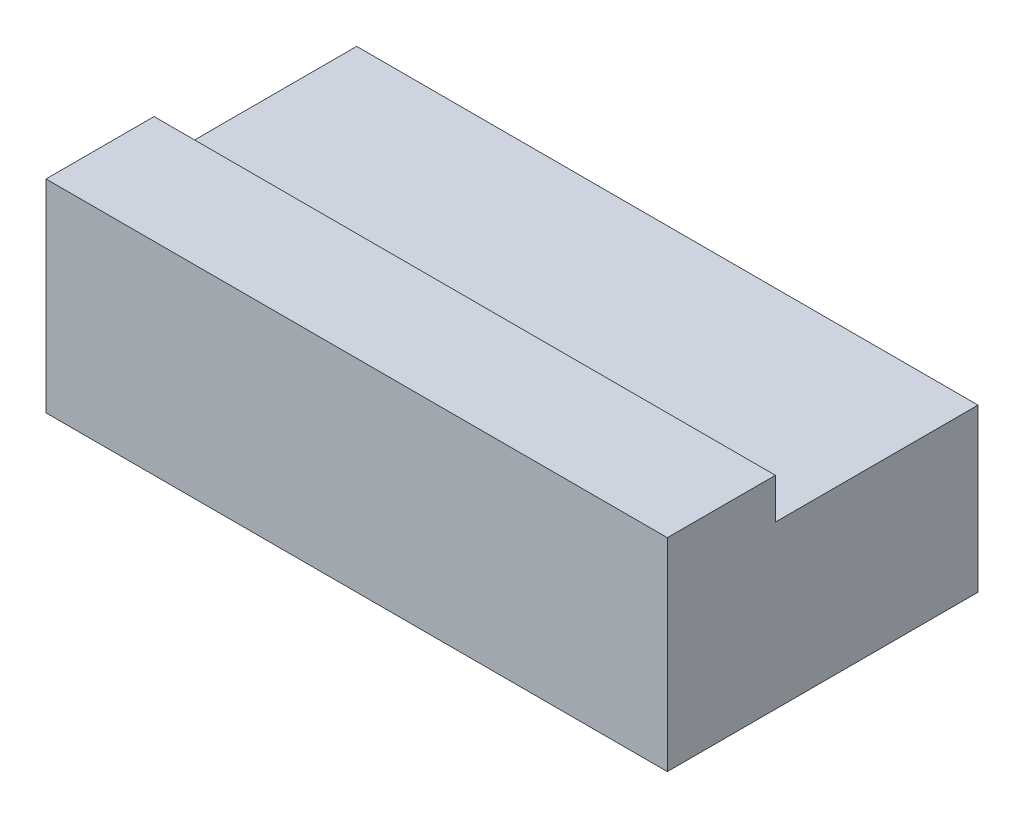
ISO-10303-21;
HEADER;
FILE_DESCRIPTION(('STEP AP214'),'2;1');
FILE_NAME('part.step','',(''),(''),'','','');
FILE_SCHEMA(('AUTOMOTIVE_DESIGN { 1 0 10303 214 1 1 1 1 }'));
ENDSEC;
DATA;
#1=APPLICATION_CONTEXT('core data for automotive mechanical design processes');
#2=APPLICATION_PROTOCOL_DEFINITION('international standard','automotive_design',2000,#1);
#3=PRODUCT_CONTEXT('',#1,'mechanical');
#4=PRODUCT('Part','Part','',(#3));
#5=PRODUCT_RELATED_PRODUCT_CATEGORY('part','',(#4));
#6=PRODUCT_DEFINITION_FORMATION('','',#4);
#7=PRODUCT_DEFINITION_CONTEXT('part definition',#1,'design');
#8=PRODUCT_DEFINITION('design','',#6,#7);
#9=PRODUCT_DEFINITION_SHAPE('','',#8);
#10=(LENGTH_UNIT() NAMED_UNIT(*) SI_UNIT(.MILLI.,.METRE.));
#11=(NAMED_UNIT(*) PLANE_ANGLE_UNIT() SI_UNIT($,.RADIAN.));
#12=(NAMED_UNIT(*) SI_UNIT($,.STERADIAN.) SOLID_ANGLE_UNIT());
#13=UNCERTAINTY_MEASURE_WITH_UNIT(LENGTH_MEASURE(1.E-05),#10,'distance_accuracy_value','');
#14=(GEOMETRIC_REPRESENTATION_CONTEXT(3) GLOBAL_UNCERTAINTY_ASSIGNED_CONTEXT((#13)) GLOBAL_UNIT_ASSIGNED_CONTEXT((#10,
#11,#12)) REPRESENTATION_CONTEXT('',''));
#15=CARTESIAN_POINT('',(0.,0.,0.));
#16=DIRECTION('',(0.,0.,1.));
#17=DIRECTION('',(1.,0.,0.));
#18=AXIS2_PLACEMENT_3D('',#15,#16,#17);
#19=CARTESIAN_POINT('',(-115.,37.5,-57.5));
#20=DIRECTION('',(0.,0.,1.));
#21=DIRECTION('',(1.,0.,0.));
#22=AXIS2_PLACEMENT_3D('',#19,#20,#21);
#23=PLANE('',#22);
#24=DIRECTION('',(-1.,0.,0.));
#25=VECTOR('',#24,1.);
#26=CARTESIAN_POINT('',(-115.,22.5,-57.5));
#27=LINE('',#26,#25);
#28=CARTESIAN_POINT('',(115.,22.5,-57.5));
#29=VERTEX_POINT('',#28);
#30=CARTESIAN_POINT('',(-115.,22.5,-57.5));
#31=VERTEX_POINT('',#30);
#32=EDGE_CURVE('E132',#29,#31,#27,.T.);
#33=ORIENTED_EDGE('',*,*,#32,.F.);
#34=DIRECTION('',(0.,-1.,0.));
#35=VECTOR('',#34,1.);
#36=CARTESIAN_POINT('',(115.,37.5,-57.5));
#37=LINE('',#36,#35);
#38=CARTESIAN_POINT('',(115.,-37.5,-57.5));
#39=VERTEX_POINT('',#38);
#40=EDGE_CURVE('E11',#29,#39,#37,.T.);
#41=ORIENTED_EDGE('',*,*,#40,.T.);
#42=DIRECTION('',(-1.,0.,0.));
#43=VECTOR('',#42,1.);
#44=CARTESIAN_POINT('',(-115.,-37.5,-57.5));
#45=LINE('',#44,#43);
#46=CARTESIAN_POINT('',(-115.,-37.5,-57.5));
#47=VERTEX_POINT('',#46);
#48=EDGE_CURVE('E106',#39,#47,#45,.T.);
#49=ORIENTED_EDGE('',*,*,#48,.T.);
#50=DIRECTION('',(0.,-1.,0.));
#51=VECTOR('',#50,1.);
#52=CARTESIAN_POINT('',(-115.,37.5,-57.5));
#53=LINE('',#52,#51);
#54=EDGE_CURVE('E47',#31,#47,#53,.T.);
#55=ORIENTED_EDGE('',*,*,#54,.F.);
#56=EDGE_LOOP('',(#33,#41,#49,#55));
#57=FACE_BOUND('',#56,.T.);
#58=ADVANCED_FACE('F38',(#57),#23,.F.);
#59=CARTESIAN_POINT('',(115.,37.5,-57.5));
#60=DIRECTION('',(-1.,0.,0.));
#61=DIRECTION('',(0.,0.,1.));
#62=AXIS2_PLACEMENT_3D('',#59,#60,#61);
#63=PLANE('',#62);
#64=DIRECTION('',(0.,0.,-1.));
#65=VECTOR('',#64,1.);
#66=CARTESIAN_POINT('',(115.,22.5,-57.5));
#67=LINE('',#66,#65);
#68=CARTESIAN_POINT('',(115.,22.5,17.5));
#69=VERTEX_POINT('',#68);
#70=EDGE_CURVE('E135',#69,#29,#67,.T.);
#71=ORIENTED_EDGE('',*,*,#70,.F.);
#72=DIRECTION('',(0.,1.,0.));
#73=VECTOR('',#72,1.);
#74=CARTESIAN_POINT('',(115.,22.5,17.5));
#75=LINE('',#74,#73);
#76=CARTESIAN_POINT('',(115.,37.5,17.5));
#77=VERTEX_POINT('',#76);
#78=EDGE_CURVE('E108',#69,#77,#75,.T.);
#79=ORIENTED_EDGE('',*,*,#78,.T.);
#80=DIRECTION('',(0.,0.,-1.));
#81=VECTOR('',#80,1.);
#82=CARTESIAN_POINT('',(115.,37.5,-57.5));
#83=LINE('',#82,#81);
#84=CARTESIAN_POINT('',(115.,37.5,57.5));
#85=VERTEX_POINT('',#84);
#86=EDGE_CURVE('E92',#85,#77,#83,.T.);
#87=ORIENTED_EDGE('',*,*,#86,.F.);
#88=DIRECTION('',(0.,-1.,0.));
#89=VECTOR('',#88,1.);
#90=CARTESIAN_POINT('',(115.,37.5,57.5));
#91=LINE('',#90,#89);
#92=CARTESIAN_POINT('',(115.,-37.5,57.5));
#93=VERTEX_POINT('',#92);
#94=EDGE_CURVE('E84',#85,#93,#91,.T.);
#95=ORIENTED_EDGE('',*,*,#94,.T.);
#96=DIRECTION('',(0.,0.,-1.));
#97=VECTOR('',#96,1.);
#98=CARTESIAN_POINT('',(115.,-37.5,-57.5));
#99=LINE('',#98,#97);
#100=EDGE_CURVE('E99',#93,#39,#99,.T.);
#101=ORIENTED_EDGE('',*,*,#100,.T.);
#102=ORIENTED_EDGE('',*,*,#40,.F.);
#103=EDGE_LOOP('',(#71,#79,#87,#95,#101,#102));
#104=FACE_BOUND('',#103,.T.);
#105=ADVANCED_FACE('F40',(#104),#63,.F.);
#106=CARTESIAN_POINT('',(-115.,37.5,-57.5));
#107=DIRECTION('',(1.,0.,0.));
#108=DIRECTION('',(0.,0.,-1.));
#109=AXIS2_PLACEMENT_3D('',#106,#107,#108);
#110=PLANE('',#109);
#111=DIRECTION('',(0.,0.,1.));
#112=VECTOR('',#111,1.);
#113=CARTESIAN_POINT('',(-115.,37.5,-57.5));
#114=LINE('',#113,#112);
#115=CARTESIAN_POINT('',(-115.,37.5,17.5));
#116=VERTEX_POINT('',#115);
#117=CARTESIAN_POINT('',(-115.,37.5,57.5));
#118=VERTEX_POINT('',#117);
#119=EDGE_CURVE('E153',#116,#118,#114,.T.);
#120=ORIENTED_EDGE('',*,*,#119,.F.);
#121=DIRECTION('',(0.,1.,0.));
#122=VECTOR('',#121,1.);
#123=CARTESIAN_POINT('',(-115.,22.5,17.5));
#124=LINE('',#123,#122);
#125=CARTESIAN_POINT('',(-115.,22.5,17.5));
#126=VERTEX_POINT('',#125);
#127=EDGE_CURVE('E54',#126,#116,#124,.T.);
#128=ORIENTED_EDGE('',*,*,#127,.F.);
#129=DIRECTION('',(0.,0.,1.));
#130=VECTOR('',#129,1.);
#131=CARTESIAN_POINT('',(-115.,22.5,-57.5));
#132=LINE('',#131,#130);
#133=EDGE_CURVE('E127',#31,#126,#132,.T.);
#134=ORIENTED_EDGE('',*,*,#133,.F.);
#135=ORIENTED_EDGE('',*,*,#54,.T.);
#136=DIRECTION('',(0.,0.,1.));
#137=VECTOR('',#136,1.);
#138=CARTESIAN_POINT('',(-115.,-37.5,-57.5));
#139=LINE('',#138,#137);
#140=CARTESIAN_POINT('',(-115.,-37.5,57.5));
#141=VERTEX_POINT('',#140);
#142=EDGE_CURVE('E93',#47,#141,#139,.T.);
#143=ORIENTED_EDGE('',*,*,#142,.T.);
#144=DIRECTION('',(0.,-1.,0.));
#145=VECTOR('',#144,1.);
#146=CARTESIAN_POINT('',(-115.,37.5,57.5));
#147=LINE('',#146,#145);
#148=EDGE_CURVE('E87',#118,#141,#147,.T.);
#149=ORIENTED_EDGE('',*,*,#148,.F.);
#150=EDGE_LOOP('',(#120,#128,#134,#135,#143,#149));
#151=FACE_BOUND('',#150,.T.);
#152=ADVANCED_FACE('F125',(#151),#110,.F.);
#153=CARTESIAN_POINT('',(-115.,37.5,57.5));
#154=DIRECTION('',(0.,0.,-1.));
#155=DIRECTION('',(-1.,0.,0.));
#156=AXIS2_PLACEMENT_3D('',#153,#154,#155);
#157=PLANE('',#156);
#158=DIRECTION('',(1.,0.,0.));
#159=VECTOR('',#158,1.);
#160=CARTESIAN_POINT('',(-115.,-37.5,57.5));
#161=LINE('',#160,#159);
#162=EDGE_CURVE('E81',#141,#93,#161,.T.);
#163=ORIENTED_EDGE('',*,*,#162,.T.);
#164=ORIENTED_EDGE('',*,*,#94,.F.);
#165=DIRECTION('',(1.,0.,0.));
#166=VECTOR('',#165,1.);
#167=CARTESIAN_POINT('',(-115.,37.5,57.5));
#168=LINE('',#167,#166);
#169=EDGE_CURVE('E63',#118,#85,#168,.T.);
#170=ORIENTED_EDGE('',*,*,#169,.F.);
#171=ORIENTED_EDGE('',*,*,#148,.T.);
#172=EDGE_LOOP('',(#163,#164,#170,#171));
#173=FACE_BOUND('',#172,.T.);
#174=ADVANCED_FACE('F83',(#173),#157,.F.);
#175=CARTESIAN_POINT('',(0.,37.5,0.));
#176=DIRECTION('',(0.,1.,0.));
#177=DIRECTION('',(0.,0.,1.));
#178=AXIS2_PLACEMENT_3D('',#175,#176,#177);
#179=PLANE('',#178);
#180=DIRECTION('',(1.,0.,0.));
#181=VECTOR('',#180,1.);
#182=CARTESIAN_POINT('',(-115.,37.5,17.5));
#183=LINE('',#182,#181);
#184=EDGE_CURVE('E145',#116,#77,#183,.T.);
#185=ORIENTED_EDGE('',*,*,#184,.F.);
#186=ORIENTED_EDGE('',*,*,#119,.T.);
#187=ORIENTED_EDGE('',*,*,#169,.T.);
#188=ORIENTED_EDGE('',*,*,#86,.T.);
#189=EDGE_LOOP('',(#185,#186,#187,#188));
#190=FACE_BOUND('',#189,.T.);
#191=ADVANCED_FACE('F163',(#190),#179,.T.);
#192=CARTESIAN_POINT('',(0.,-37.5,0.));
#193=DIRECTION('',(0.,1.,0.));
#194=DIRECTION('',(0.,0.,1.));
#195=AXIS2_PLACEMENT_3D('',#192,#193,#194);
#196=PLANE('',#195);
#197=ORIENTED_EDGE('',*,*,#100,.F.);
#198=ORIENTED_EDGE('',*,*,#162,.F.);
#199=ORIENTED_EDGE('',*,*,#142,.F.);
#200=ORIENTED_EDGE('',*,*,#48,.F.);
#201=EDGE_LOOP('',(#197,#198,#199,#200));
#202=FACE_BOUND('',#201,.T.);
#203=ADVANCED_FACE('F104',(#202),#196,.F.);
#204=CARTESIAN_POINT('',(-115.,22.5,17.5));
#205=DIRECTION('',(0.,0.,1.));
#206=DIRECTION('',(1.,0.,0.));
#207=AXIS2_PLACEMENT_3D('',#204,#205,#206);
#208=PLANE('',#207);
#209=ORIENTED_EDGE('',*,*,#184,.T.);
#210=ORIENTED_EDGE('',*,*,#78,.F.);
#211=DIRECTION('',(1.,0.,0.));
#212=VECTOR('',#211,1.);
#213=CARTESIAN_POINT('',(-115.,22.5,17.5));
#214=LINE('',#213,#212);
#215=EDGE_CURVE('E146',#126,#69,#214,.T.);
#216=ORIENTED_EDGE('',*,*,#215,.F.);
#217=ORIENTED_EDGE('',*,*,#127,.T.);
#218=EDGE_LOOP('',(#209,#210,#216,#217));
#219=FACE_BOUND('',#218,.T.);
#220=ADVANCED_FACE('F147',(#219),#208,.F.);
#221=CARTESIAN_POINT('',(0.,22.5,0.));
#222=DIRECTION('',(0.,1.,0.));
#223=DIRECTION('',(0.,0.,1.));
#224=AXIS2_PLACEMENT_3D('',#221,#222,#223);
#225=PLANE('',#224);
#226=ORIENTED_EDGE('',*,*,#133,.T.);
#227=ORIENTED_EDGE('',*,*,#215,.T.);
#228=ORIENTED_EDGE('',*,*,#70,.T.);
#229=ORIENTED_EDGE('',*,*,#32,.T.);
#230=EDGE_LOOP('',(#226,#227,#228,#229));
#231=FACE_BOUND('',#230,.T.);
#232=ADVANCED_FACE('F150',(#231),#225,.T.);
#233=CLOSED_SHELL('',(#58,#105,#152,#174,#191,#203,#220,#232));
#234=MANIFOLD_SOLID_BREP('B2',#233);
#235=ADVANCED_BREP_SHAPE_REPRESENTATION('',(#18,#234),#14);
#236=SHAPE_DEFINITION_REPRESENTATION(#9,#235);
ENDSEC;
END-ISO-10303-21;
